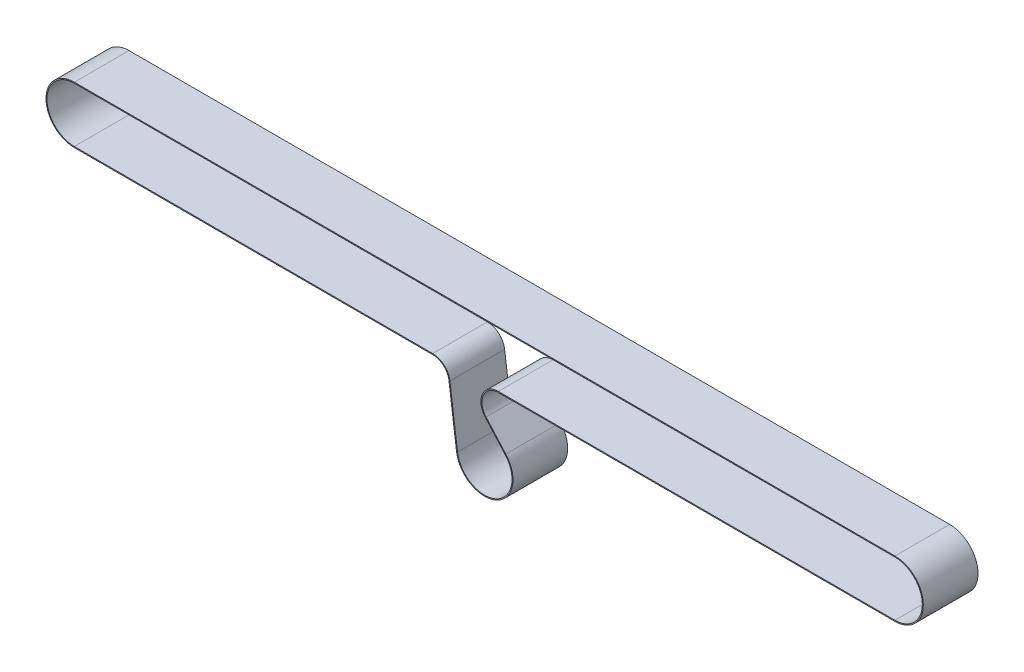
ISO-10303-21;
HEADER;
FILE_DESCRIPTION(('STEP AP214'),'2;1');
FILE_NAME('part.step','',(''),(''),'','','');
FILE_SCHEMA(('AUTOMOTIVE_DESIGN { 1 0 10303 214 1 1 1 1 }'));
ENDSEC;
DATA;
#1=APPLICATION_CONTEXT('core data for automotive mechanical design processes');
#2=APPLICATION_PROTOCOL_DEFINITION('international standard','automotive_design',2000,#1);
#3=PRODUCT_CONTEXT('',#1,'mechanical');
#4=PRODUCT('Part','Part','',(#3));
#5=PRODUCT_RELATED_PRODUCT_CATEGORY('part','',(#4));
#6=PRODUCT_DEFINITION_FORMATION('','',#4);
#7=PRODUCT_DEFINITION_CONTEXT('part definition',#1,'design');
#8=PRODUCT_DEFINITION('design','',#6,#7);
#9=PRODUCT_DEFINITION_SHAPE('','',#8);
#10=(LENGTH_UNIT() NAMED_UNIT(*) SI_UNIT(.MILLI.,.METRE.));
#11=(NAMED_UNIT(*) PLANE_ANGLE_UNIT() SI_UNIT($,.RADIAN.));
#12=(NAMED_UNIT(*) SI_UNIT($,.STERADIAN.) SOLID_ANGLE_UNIT());
#13=UNCERTAINTY_MEASURE_WITH_UNIT(LENGTH_MEASURE(1.E-05),#10,'distance_accuracy_value','');
#14=(GEOMETRIC_REPRESENTATION_CONTEXT(3) GLOBAL_UNCERTAINTY_ASSIGNED_CONTEXT((#13)) GLOBAL_UNIT_ASSIGNED_CONTEXT((#10,
#11,#12)) REPRESENTATION_CONTEXT('',''));
#15=CARTESIAN_POINT('',(0.,0.,0.));
#16=DIRECTION('',(0.,0.,1.));
#17=DIRECTION('',(1.,0.,0.));
#18=AXIS2_PLACEMENT_3D('',#15,#16,#17);
#19=CARTESIAN_POINT('',(0.,0.,25.));
#20=DIRECTION('',(0.,0.,1.));
#21=DIRECTION('',(1.,0.,0.));
#22=AXIS2_PLACEMENT_3D('',#19,#20,#21);
#23=PLANE('',#22);
#24=CARTESIAN_POINT('',(0.,0.,25.));
#25=DIRECTION('',(0.,0.,1.));
#26=DIRECTION('',(1.,0.,0.));
#27=AXIS2_PLACEMENT_3D('',#24,#25,#26);
#28=CIRCLE('',#27,25.9);
#29=CARTESIAN_POINT('',(0.,25.9,25.));
#30=VERTEX_POINT('',#29);
#31=CARTESIAN_POINT('',(-0.00790824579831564,-25.8999987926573,25.));
#32=VERTEX_POINT('',#31);
#33=EDGE_CURVE('E164',#30,#32,#28,.T.);
#34=ORIENTED_EDGE('',*,*,#33,.T.);
#35=DIRECTION('',(0.999999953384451,-0.000305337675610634,0.));
#36=VECTOR('',#35,1.);
#37=CARTESIAN_POINT('',(-0.00790824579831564,-25.8999987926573,25.));
#38=LINE('',#37,#36);
#39=CARTESIAN_POINT('',(327.504580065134,-26.0000006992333,25.));
#40=VERTEX_POINT('',#39);
#41=EDGE_CURVE('E267',#32,#40,#38,.T.);
#42=ORIENTED_EDGE('',*,*,#41,.T.);
#43=CARTESIAN_POINT('',(327.5,-41.,25.));
#44=DIRECTION('',(0.,0.,-1.));
#45=DIRECTION('',(-1.,0.,0.));
#46=AXIS2_PLACEMENT_3D('',#43,#44,#45);
#47=CIRCLE('',#46,15.);
#48=CARTESIAN_POINT('',(342.371906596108,-39.0438828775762,25.));
#49=VERTEX_POINT('',#48);
#50=EDGE_CURVE('E269',#40,#49,#47,.T.);
#51=ORIENTED_EDGE('',*,*,#50,.T.);
#52=DIRECTION('',(0.130407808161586,-0.991460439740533,0.));
#53=VECTOR('',#52,1.);
#54=CARTESIAN_POINT('',(342.371906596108,-39.0438828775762,25.));
#55=LINE('',#54,#53);
#56=CARTESIAN_POINT('',(349.321174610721,-91.8775622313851,25.));
#57=VERTEX_POINT('',#56);
#58=EDGE_CURVE('E271',#49,#57,#55,.T.);
#59=ORIENTED_EDGE('',*,*,#58,.T.);
#60=CARTESIAN_POINT('',(375.,-88.5,25.));
#61=DIRECTION('',(0.,0.,1.));
#62=DIRECTION('',(1.,0.,0.));
#63=AXIS2_PLACEMENT_3D('',#60,#61,#62);
#64=CIRCLE('',#63,25.9);
#65=CARTESIAN_POINT('',(394.357837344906,-71.2929045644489,25.));
#66=VERTEX_POINT('',#65);
#67=EDGE_CURVE('E273',#57,#66,#64,.T.);
#68=ORIENTED_EDGE('',*,*,#67,.T.);
#69=DIRECTION('',(-0.664366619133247,0.747406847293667,0.));
#70=VECTOR('',#69,1.);
#71=CARTESIAN_POINT('',(394.357837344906,-71.2929045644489,25.));
#72=LINE('',#71,#70);
#73=CARTESIAN_POINT('',(376.288897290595,-50.9654992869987,25.));
#74=VERTEX_POINT('',#73);
#75=EDGE_CURVE('E275',#66,#74,#72,.T.);
#76=ORIENTED_EDGE('',*,*,#75,.T.);
#77=CARTESIAN_POINT('',(387.5,-41.,25.));
#78=DIRECTION('',(0.,0.,-1.));
#79=DIRECTION('',(-1.,0.,0.));
#80=AXIS2_PLACEMENT_3D('',#77,#78,#79);
#81=CIRCLE('',#80,15.);
#82=CARTESIAN_POINT('',(387.495862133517,-26.0000005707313,25.));
#83=VERTEX_POINT('',#82);
#84=EDGE_CURVE('E277',#74,#83,#81,.T.);
#85=ORIENTED_EDGE('',*,*,#84,.T.);
#86=DIRECTION('',(0.999999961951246,0.000275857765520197,0.));
#87=VECTOR('',#86,1.);
#88=CARTESIAN_POINT('',(387.495862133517,-26.0000005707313,25.));
#89=LINE('',#88,#87);
#90=CARTESIAN_POINT('',(750.007144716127,-25.8999990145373,25.));
#91=VERTEX_POINT('',#90);
#92=EDGE_CURVE('E279',#83,#91,#89,.T.);
#93=ORIENTED_EDGE('',*,*,#92,.T.);
#94=CARTESIAN_POINT('',(750.003448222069,4.75609473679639E-07,25.));
#95=DIRECTION('',(0.,0.,1.));
#96=DIRECTION('',(1.,0.,0.));
#97=AXIS2_PLACEMENT_3D('',#94,#95,#96);
#98=CIRCLE('',#97,25.8999997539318);
#99=CARTESIAN_POINT('',(750.003448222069,25.9000002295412,25.));
#100=VERTEX_POINT('',#99);
#101=EDGE_CURVE('E281',#91,#100,#98,.T.);
#102=ORIENTED_EDGE('',*,*,#101,.T.);
#103=DIRECTION('',(-1.,-3.06053621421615E-10,0.));
#104=VECTOR('',#103,1.);
#105=CARTESIAN_POINT('',(750.003448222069,25.9000002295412,25.));
#106=LINE('',#105,#104);
#107=EDGE_CURVE('E39',#100,#30,#106,.T.);
#108=ORIENTED_EDGE('',*,*,#107,.T.);
#109=EDGE_LOOP('',(#34,#42,#51,#59,#68,#76,#85,#93,#102,#108));
#110=FACE_BOUND('',#109,.T.);
#111=DIRECTION('',(0.999999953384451,-0.000305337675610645,0.));
#112=VECTOR('',#111,1.);
#113=CARTESIAN_POINT('',(-0.00763344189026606,-24.9999988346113,25.));
#114=LINE('',#113,#112);
#115=CARTESIAN_POINT('',(-0.00763344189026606,-24.9999988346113,25.));
#116=VERTEX_POINT('',#115);
#117=CARTESIAN_POINT('',(327.504854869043,-25.1000007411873,25.));
#118=VERTEX_POINT('',#117);
#119=EDGE_CURVE('E232',#116,#118,#114,.T.);
#120=ORIENTED_EDGE('',*,*,#119,.F.);
#121=CARTESIAN_POINT('',(0.,0.,25.));
#122=DIRECTION('',(0.,0.,1.));
#123=DIRECTION('',(1.,0.,0.));
#124=AXIS2_PLACEMENT_3D('',#121,#122,#123);
#125=CIRCLE('',#124,25.);
#126=CARTESIAN_POINT('',(0.,25.,25.));
#127=VERTEX_POINT('',#126);
#128=EDGE_CURVE('E161',#127,#116,#125,.T.);
#129=ORIENTED_EDGE('',*,*,#128,.F.);
#130=DIRECTION('',(-1.,0.,0.));
#131=VECTOR('',#130,1.);
#132=CARTESIAN_POINT('',(750.,25.,25.));
#133=LINE('',#132,#131);
#134=CARTESIAN_POINT('',(750.,25.,25.));
#135=VERTEX_POINT('',#134);
#136=EDGE_CURVE('E248',#135,#127,#133,.T.);
#137=ORIENTED_EDGE('',*,*,#136,.F.);
#138=CARTESIAN_POINT('',(750.003448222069,4.75609473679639E-07,25.));
#139=DIRECTION('',(0.,0.,1.));
#140=DIRECTION('',(1.,0.,0.));
#141=AXIS2_PLACEMENT_3D('',#138,#139,#140);
#142=CIRCLE('',#141,24.9999997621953);
#143=CARTESIAN_POINT('',(750.006896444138,-24.9999990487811,25.));
#144=VERTEX_POINT('',#143);
#145=EDGE_CURVE('E246',#144,#135,#142,.T.);
#146=ORIENTED_EDGE('',*,*,#145,.F.);
#147=DIRECTION('',(0.999999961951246,0.000275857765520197,0.));
#148=VECTOR('',#147,1.);
#149=CARTESIAN_POINT('',(387.495613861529,-25.1000006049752,25.));
#150=LINE('',#149,#148);
#151=CARTESIAN_POINT('',(387.495613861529,-25.1000006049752,25.));
#152=VERTEX_POINT('',#151);
#153=EDGE_CURVE('E244',#152,#144,#150,.T.);
#154=ORIENTED_EDGE('',*,*,#153,.F.);
#155=CARTESIAN_POINT('',(387.5,-41.,25.));
#156=DIRECTION('',(0.,0.,-1.));
#157=DIRECTION('',(-1.,0.,0.));
#158=AXIS2_PLACEMENT_3D('',#155,#156,#157);
#159=CIRCLE('',#158,15.9);
#160=CARTESIAN_POINT('',(375.616231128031,-51.5634292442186,25.));
#161=VERTEX_POINT('',#160);
#162=EDGE_CURVE('E242',#161,#152,#159,.T.);
#163=ORIENTED_EDGE('',*,*,#162,.F.);
#164=DIRECTION('',(-0.664366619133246,0.747406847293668,0.));
#165=VECTOR('',#164,1.);
#166=CARTESIAN_POINT('',(393.685171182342,-71.8908345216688,25.));
#167=LINE('',#166,#165);
#168=CARTESIAN_POINT('',(393.685171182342,-71.8908345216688,25.));
#169=VERTEX_POINT('',#168);
#170=EDGE_CURVE('E240',#169,#161,#167,.T.);
#171=ORIENTED_EDGE('',*,*,#170,.F.);
#172=CARTESIAN_POINT('',(375.,-88.5,25.));
#173=DIRECTION('',(0.,0.,1.));
#174=DIRECTION('',(1.,0.,0.));
#175=AXIS2_PLACEMENT_3D('',#172,#173,#174);
#176=CIRCLE('',#175,25.);
#177=CARTESIAN_POINT('',(350.213489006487,-91.7601952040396,25.));
#178=VERTEX_POINT('',#177);
#179=EDGE_CURVE('E238',#178,#169,#176,.T.);
#180=ORIENTED_EDGE('',*,*,#179,.F.);
#181=DIRECTION('',(0.130407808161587,-0.991460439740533,0.));
#182=VECTOR('',#181,1.);
#183=CARTESIAN_POINT('',(343.264220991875,-38.9265158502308,25.));
#184=LINE('',#183,#182);
#185=CARTESIAN_POINT('',(343.264220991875,-38.9265158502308,25.));
#186=VERTEX_POINT('',#185);
#187=EDGE_CURVE('E236',#186,#178,#184,.T.);
#188=ORIENTED_EDGE('',*,*,#187,.F.);
#189=CARTESIAN_POINT('',(327.5,-41.,25.));
#190=DIRECTION('',(0.,0.,-1.));
#191=DIRECTION('',(-1.,0.,0.));
#192=AXIS2_PLACEMENT_3D('',#189,#190,#191);
#193=CIRCLE('',#192,15.9);
#194=EDGE_CURVE('E234',#118,#186,#193,.T.);
#195=ORIENTED_EDGE('',*,*,#194,.F.);
#196=EDGE_LOOP('',(#120,#129,#137,#146,#154,#163,#171,#180,#188,#195));
#197=FACE_BOUND('',#196,.T.);
#198=ADVANCED_FACE('F16',(#110,#197),#23,.T.);
#199=CARTESIAN_POINT('',(0.,0.,25.));
#200=DIRECTION('',(0.,0.,-1.));
#201=DIRECTION('',(-1.,0.,0.));
#202=AXIS2_PLACEMENT_3D('',#199,#200,#201);
#203=CYLINDRICAL_SURFACE('',#202,25.9);
#204=DIRECTION('',(0.,0.,-1.));
#205=VECTOR('',#204,1.);
#206=CARTESIAN_POINT('',(0.,25.9,25.));
#207=LINE('',#206,#205);
#208=CARTESIAN_POINT('',(0.,25.9,-25.));
#209=VERTEX_POINT('',#208);
#210=EDGE_CURVE('E284',#30,#209,#207,.T.);
#211=ORIENTED_EDGE('',*,*,#210,.T.);
#212=CARTESIAN_POINT('',(0.,0.,-25.));
#213=DIRECTION('',(0.,0.,1.));
#214=DIRECTION('',(1.,0.,0.));
#215=AXIS2_PLACEMENT_3D('',#212,#213,#214);
#216=CIRCLE('',#215,25.9);
#217=CARTESIAN_POINT('',(-0.00790824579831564,-25.8999987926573,-25.));
#218=VERTEX_POINT('',#217);
#219=EDGE_CURVE('E201',#209,#218,#216,.T.);
#220=ORIENTED_EDGE('',*,*,#219,.T.);
#221=DIRECTION('',(0.,0.,-1.));
#222=VECTOR('',#221,1.);
#223=CARTESIAN_POINT('',(-0.00790824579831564,-25.8999987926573,25.));
#224=LINE('',#223,#222);
#225=EDGE_CURVE('E11',#32,#218,#224,.T.);
#226=ORIENTED_EDGE('',*,*,#225,.F.);
#227=ORIENTED_EDGE('',*,*,#33,.F.);
#228=EDGE_LOOP('',(#211,#220,#226,#227));
#229=FACE_BOUND('',#228,.T.);
#230=ADVANCED_FACE('F18',(#229),#203,.T.);
#231=CARTESIAN_POINT('',(-0.00790824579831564,-25.8999987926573,25.));
#232=DIRECTION('',(0.000305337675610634,0.999999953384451,0.));
#233=DIRECTION('',(-0.999999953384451,0.000305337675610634,0.));
#234=AXIS2_PLACEMENT_3D('',#231,#232,#233);
#235=PLANE('',#234);
#236=ORIENTED_EDGE('',*,*,#225,.T.);
#237=DIRECTION('',(0.999999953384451,-0.000305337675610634,0.));
#238=VECTOR('',#237,1.);
#239=CARTESIAN_POINT('',(-0.00790824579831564,-25.8999987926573,-25.));
#240=LINE('',#239,#238);
#241=CARTESIAN_POINT('',(327.504580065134,-26.0000006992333,-25.));
#242=VERTEX_POINT('',#241);
#243=EDGE_CURVE('E204',#218,#242,#240,.T.);
#244=ORIENTED_EDGE('',*,*,#243,.T.);
#245=DIRECTION('',(0.,0.,-1.));
#246=VECTOR('',#245,1.);
#247=CARTESIAN_POINT('',(327.504580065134,-26.0000006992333,25.));
#248=LINE('',#247,#246);
#249=EDGE_CURVE('E24',#40,#242,#248,.T.);
#250=ORIENTED_EDGE('',*,*,#249,.F.);
#251=ORIENTED_EDGE('',*,*,#41,.F.);
#252=EDGE_LOOP('',(#236,#244,#250,#251));
#253=FACE_BOUND('',#252,.T.);
#254=ADVANCED_FACE('F310',(#253),#235,.F.);
#255=CARTESIAN_POINT('',(327.5,-41.,25.));
#256=DIRECTION('',(0.,0.,-1.));
#257=DIRECTION('',(-1.,0.,0.));
#258=AXIS2_PLACEMENT_3D('',#255,#256,#257);
#259=CYLINDRICAL_SURFACE('',#258,15.);
#260=ORIENTED_EDGE('',*,*,#249,.T.);
#261=CARTESIAN_POINT('',(327.5,-41.,-25.));
#262=DIRECTION('',(0.,0.,-1.));
#263=DIRECTION('',(-1.,0.,0.));
#264=AXIS2_PLACEMENT_3D('',#261,#262,#263);
#265=CIRCLE('',#264,15.);
#266=CARTESIAN_POINT('',(342.371906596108,-39.0438828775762,-25.));
#267=VERTEX_POINT('',#266);
#268=EDGE_CURVE('E207',#242,#267,#265,.T.);
#269=ORIENTED_EDGE('',*,*,#268,.T.);
#270=DIRECTION('',(0.,0.,-1.));
#271=VECTOR('',#270,1.);
#272=CARTESIAN_POINT('',(342.371906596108,-39.0438828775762,25.));
#273=LINE('',#272,#271);
#274=EDGE_CURVE('E298',#49,#267,#273,.T.);
#275=ORIENTED_EDGE('',*,*,#274,.F.);
#276=ORIENTED_EDGE('',*,*,#50,.F.);
#277=EDGE_LOOP('',(#260,#269,#275,#276));
#278=FACE_BOUND('',#277,.T.);
#279=ADVANCED_FACE('F303',(#278),#259,.F.);
#280=CARTESIAN_POINT('',(342.371906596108,-39.0438828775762,25.));
#281=DIRECTION('',(0.991460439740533,0.130407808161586,0.));
#282=DIRECTION('',(-0.130407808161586,0.991460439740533,0.));
#283=AXIS2_PLACEMENT_3D('',#280,#281,#282);
#284=PLANE('',#283);
#285=ORIENTED_EDGE('',*,*,#274,.T.);
#286=DIRECTION('',(0.130407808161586,-0.991460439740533,0.));
#287=VECTOR('',#286,1.);
#288=CARTESIAN_POINT('',(342.371906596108,-39.0438828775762,-25.));
#289=LINE('',#288,#287);
#290=CARTESIAN_POINT('',(349.321174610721,-91.8775622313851,-25.));
#291=VERTEX_POINT('',#290);
#292=EDGE_CURVE('E210',#267,#291,#289,.T.);
#293=ORIENTED_EDGE('',*,*,#292,.T.);
#294=DIRECTION('',(0.,0.,-1.));
#295=VECTOR('',#294,1.);
#296=CARTESIAN_POINT('',(349.321174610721,-91.8775622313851,25.));
#297=LINE('',#296,#295);
#298=EDGE_CURVE('E296',#57,#291,#297,.T.);
#299=ORIENTED_EDGE('',*,*,#298,.F.);
#300=ORIENTED_EDGE('',*,*,#58,.F.);
#301=EDGE_LOOP('',(#285,#293,#299,#300));
#302=FACE_BOUND('',#301,.T.);
#303=ADVANCED_FACE('F343',(#302),#284,.F.);
#304=CARTESIAN_POINT('',(375.,-88.5,25.));
#305=DIRECTION('',(0.,0.,-1.));
#306=DIRECTION('',(-1.,0.,0.));
#307=AXIS2_PLACEMENT_3D('',#304,#305,#306);
#308=CYLINDRICAL_SURFACE('',#307,25.9);
#309=ORIENTED_EDGE('',*,*,#298,.T.);
#310=CARTESIAN_POINT('',(375.,-88.5,-25.));
#311=DIRECTION('',(0.,0.,1.));
#312=DIRECTION('',(1.,0.,0.));
#313=AXIS2_PLACEMENT_3D('',#310,#311,#312);
#314=CIRCLE('',#313,25.9);
#315=CARTESIAN_POINT('',(394.357837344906,-71.2929045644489,-25.));
#316=VERTEX_POINT('',#315);
#317=EDGE_CURVE('E213',#291,#316,#314,.T.);
#318=ORIENTED_EDGE('',*,*,#317,.T.);
#319=DIRECTION('',(0.,0.,-1.));
#320=VECTOR('',#319,1.);
#321=CARTESIAN_POINT('',(394.357837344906,-71.2929045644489,25.));
#322=LINE('',#321,#320);
#323=EDGE_CURVE('E294',#66,#316,#322,.T.);
#324=ORIENTED_EDGE('',*,*,#323,.F.);
#325=ORIENTED_EDGE('',*,*,#67,.F.);
#326=EDGE_LOOP('',(#309,#318,#324,#325));
#327=FACE_BOUND('',#326,.T.);
#328=ADVANCED_FACE('F340',(#327),#308,.T.);
#329=CARTESIAN_POINT('',(394.357837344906,-71.2929045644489,25.));
#330=DIRECTION('',(-0.747406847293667,-0.664366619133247,0.));
#331=DIRECTION('',(0.664366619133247,-0.747406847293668,0.));
#332=AXIS2_PLACEMENT_3D('',#329,#330,#331);
#333=PLANE('',#332);
#334=ORIENTED_EDGE('',*,*,#323,.T.);
#335=DIRECTION('',(-0.664366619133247,0.747406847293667,0.));
#336=VECTOR('',#335,1.);
#337=CARTESIAN_POINT('',(394.357837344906,-71.2929045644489,-25.));
#338=LINE('',#337,#336);
#339=CARTESIAN_POINT('',(376.288897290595,-50.9654992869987,-25.));
#340=VERTEX_POINT('',#339);
#341=EDGE_CURVE('E216',#316,#340,#338,.T.);
#342=ORIENTED_EDGE('',*,*,#341,.T.);
#343=DIRECTION('',(0.,0.,-1.));
#344=VECTOR('',#343,1.);
#345=CARTESIAN_POINT('',(376.288897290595,-50.9654992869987,25.));
#346=LINE('',#345,#344);
#347=EDGE_CURVE('E292',#74,#340,#346,.T.);
#348=ORIENTED_EDGE('',*,*,#347,.F.);
#349=ORIENTED_EDGE('',*,*,#75,.F.);
#350=EDGE_LOOP('',(#334,#342,#348,#349));
#351=FACE_BOUND('',#350,.T.);
#352=ADVANCED_FACE('F335',(#351),#333,.F.);
#353=CARTESIAN_POINT('',(387.5,-41.,25.));
#354=DIRECTION('',(0.,0.,-1.));
#355=DIRECTION('',(-1.,0.,0.));
#356=AXIS2_PLACEMENT_3D('',#353,#354,#355);
#357=CYLINDRICAL_SURFACE('',#356,15.);
#358=ORIENTED_EDGE('',*,*,#347,.T.);
#359=CARTESIAN_POINT('',(387.5,-41.,-25.));
#360=DIRECTION('',(0.,0.,-1.));
#361=DIRECTION('',(-1.,0.,0.));
#362=AXIS2_PLACEMENT_3D('',#359,#360,#361);
#363=CIRCLE('',#362,15.);
#364=CARTESIAN_POINT('',(387.495862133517,-26.0000005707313,-25.));
#365=VERTEX_POINT('',#364);
#366=EDGE_CURVE('E219',#340,#365,#363,.T.);
#367=ORIENTED_EDGE('',*,*,#366,.T.);
#368=DIRECTION('',(0.,0.,-1.));
#369=VECTOR('',#368,1.);
#370=CARTESIAN_POINT('',(387.495862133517,-26.0000005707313,25.));
#371=LINE('',#370,#369);
#372=EDGE_CURVE('E290',#83,#365,#371,.T.);
#373=ORIENTED_EDGE('',*,*,#372,.F.);
#374=ORIENTED_EDGE('',*,*,#84,.F.);
#375=EDGE_LOOP('',(#358,#367,#373,#374));
#376=FACE_BOUND('',#375,.T.);
#377=ADVANCED_FACE('F331',(#376),#357,.F.);
#378=CARTESIAN_POINT('',(387.495862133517,-26.0000005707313,25.));
#379=DIRECTION('',(-0.000275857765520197,0.999999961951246,0.));
#380=DIRECTION('',(-0.999999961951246,-0.000275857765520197,0.));
#381=AXIS2_PLACEMENT_3D('',#378,#379,#380);
#382=PLANE('',#381);
#383=ORIENTED_EDGE('',*,*,#372,.T.);
#384=DIRECTION('',(0.999999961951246,0.000275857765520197,0.));
#385=VECTOR('',#384,1.);
#386=CARTESIAN_POINT('',(387.495862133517,-26.0000005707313,-25.));
#387=LINE('',#386,#385);
#388=CARTESIAN_POINT('',(750.007144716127,-25.8999990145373,-25.));
#389=VERTEX_POINT('',#388);
#390=EDGE_CURVE('E222',#365,#389,#387,.T.);
#391=ORIENTED_EDGE('',*,*,#390,.T.);
#392=DIRECTION('',(0.,0.,-1.));
#393=VECTOR('',#392,1.);
#394=CARTESIAN_POINT('',(750.007144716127,-25.8999990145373,25.));
#395=LINE('',#394,#393);
#396=EDGE_CURVE('E288',#91,#389,#395,.T.);
#397=ORIENTED_EDGE('',*,*,#396,.F.);
#398=ORIENTED_EDGE('',*,*,#92,.F.);
#399=EDGE_LOOP('',(#383,#391,#397,#398));
#400=FACE_BOUND('',#399,.T.);
#401=ADVANCED_FACE('F326',(#400),#382,.F.);
#402=CARTESIAN_POINT('',(750.003448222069,4.75609473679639E-07,25.));
#403=DIRECTION('',(0.,0.,-1.));
#404=DIRECTION('',(-1.,0.,0.));
#405=AXIS2_PLACEMENT_3D('',#402,#403,#404);
#406=CYLINDRICAL_SURFACE('',#405,25.8999997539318);
#407=ORIENTED_EDGE('',*,*,#396,.T.);
#408=CARTESIAN_POINT('',(750.003448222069,4.75609473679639E-07,-25.));
#409=DIRECTION('',(0.,0.,1.));
#410=DIRECTION('',(1.,0.,0.));
#411=AXIS2_PLACEMENT_3D('',#408,#409,#410);
#412=CIRCLE('',#411,25.8999997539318);
#413=CARTESIAN_POINT('',(750.003448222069,25.9000002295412,-25.));
#414=VERTEX_POINT('',#413);
#415=EDGE_CURVE('E225',#389,#414,#412,.T.);
#416=ORIENTED_EDGE('',*,*,#415,.T.);
#417=DIRECTION('',(0.,0.,-1.));
#418=VECTOR('',#417,1.);
#419=CARTESIAN_POINT('',(750.003448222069,25.9000002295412,25.));
#420=LINE('',#419,#418);
#421=EDGE_CURVE('E286',#100,#414,#420,.T.);
#422=ORIENTED_EDGE('',*,*,#421,.F.);
#423=ORIENTED_EDGE('',*,*,#101,.F.);
#424=EDGE_LOOP('',(#407,#416,#422,#423));
#425=FACE_BOUND('',#424,.T.);
#426=ADVANCED_FACE('F321',(#425),#406,.T.);
#427=CARTESIAN_POINT('',(750.003448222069,25.9000002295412,25.));
#428=DIRECTION('',(3.06053621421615E-10,-1.,0.));
#429=DIRECTION('',(1.,3.06053621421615E-10,0.));
#430=AXIS2_PLACEMENT_3D('',#427,#428,#429);
#431=PLANE('',#430);
#432=ORIENTED_EDGE('',*,*,#421,.T.);
#433=DIRECTION('',(-1.,-3.06053621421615E-10,0.));
#434=VECTOR('',#433,1.);
#435=CARTESIAN_POINT('',(750.003448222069,25.9000002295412,-25.));
#436=LINE('',#435,#434);
#437=EDGE_CURVE('E228',#414,#209,#436,.T.);
#438=ORIENTED_EDGE('',*,*,#437,.T.);
#439=ORIENTED_EDGE('',*,*,#210,.F.);
#440=ORIENTED_EDGE('',*,*,#107,.F.);
#441=EDGE_LOOP('',(#432,#438,#439,#440));
#442=FACE_BOUND('',#441,.T.);
#443=ADVANCED_FACE('F317',(#442),#431,.F.);
#444=CARTESIAN_POINT('',(0.,0.,25.));
#445=DIRECTION('',(0.,0.,-1.));
#446=DIRECTION('',(-1.,0.,0.));
#447=AXIS2_PLACEMENT_3D('',#444,#445,#446);
#448=CYLINDRICAL_SURFACE('',#447,25.);
#449=DIRECTION('',(0.,0.,-1.));
#450=VECTOR('',#449,1.);
#451=CARTESIAN_POINT('',(-0.00763344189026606,-24.9999988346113,25.));
#452=LINE('',#451,#450);
#453=CARTESIAN_POINT('',(-0.00763344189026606,-24.9999988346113,-25.));
#454=VERTEX_POINT('',#453);
#455=EDGE_CURVE('E153',#116,#454,#452,.T.);
#456=ORIENTED_EDGE('',*,*,#455,.T.);
#457=CARTESIAN_POINT('',(0.,0.,-25.));
#458=DIRECTION('',(0.,0.,1.));
#459=DIRECTION('',(1.,0.,0.));
#460=AXIS2_PLACEMENT_3D('',#457,#458,#459);
#461=CIRCLE('',#460,25.);
#462=CARTESIAN_POINT('',(0.,25.,-25.));
#463=VERTEX_POINT('',#462);
#464=EDGE_CURVE('E158',#463,#454,#461,.T.);
#465=ORIENTED_EDGE('',*,*,#464,.F.);
#466=DIRECTION('',(0.,0.,-1.));
#467=VECTOR('',#466,1.);
#468=CARTESIAN_POINT('',(0.,25.,25.));
#469=LINE('',#468,#467);
#470=EDGE_CURVE('E250',#127,#463,#469,.T.);
#471=ORIENTED_EDGE('',*,*,#470,.F.);
#472=ORIENTED_EDGE('',*,*,#128,.T.);
#473=EDGE_LOOP('',(#456,#465,#471,#472));
#474=FACE_BOUND('',#473,.T.);
#475=ADVANCED_FACE('F155',(#474),#448,.F.);
#476=CARTESIAN_POINT('',(-0.00763344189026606,-24.9999988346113,25.));
#477=DIRECTION('',(0.000305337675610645,0.999999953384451,0.));
#478=DIRECTION('',(-0.999999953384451,0.000305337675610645,0.));
#479=AXIS2_PLACEMENT_3D('',#476,#477,#478);
#480=PLANE('',#479);
#481=DIRECTION('',(0.,0.,-1.));
#482=VECTOR('',#481,1.);
#483=CARTESIAN_POINT('',(327.504854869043,-25.1000007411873,25.));
#484=LINE('',#483,#482);
#485=CARTESIAN_POINT('',(327.504854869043,-25.1000007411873,-25.));
#486=VERTEX_POINT('',#485);
#487=EDGE_CURVE('E165',#118,#486,#484,.T.);
#488=ORIENTED_EDGE('',*,*,#487,.T.);
#489=DIRECTION('',(0.999999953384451,-0.000305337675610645,0.));
#490=VECTOR('',#489,1.);
#491=CARTESIAN_POINT('',(-0.00763344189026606,-24.9999988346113,-25.));
#492=LINE('',#491,#490);
#493=EDGE_CURVE('E168',#454,#486,#492,.T.);
#494=ORIENTED_EDGE('',*,*,#493,.F.);
#495=ORIENTED_EDGE('',*,*,#455,.F.);
#496=ORIENTED_EDGE('',*,*,#119,.T.);
#497=EDGE_LOOP('',(#488,#494,#495,#496));
#498=FACE_BOUND('',#497,.T.);
#499=ADVANCED_FACE('F169',(#498),#480,.T.);
#500=CARTESIAN_POINT('',(327.5,-41.,25.));
#501=DIRECTION('',(0.,0.,-1.));
#502=DIRECTION('',(-1.,0.,0.));
#503=AXIS2_PLACEMENT_3D('',#500,#501,#502);
#504=CYLINDRICAL_SURFACE('',#503,15.9);
#505=DIRECTION('',(0.,0.,-1.));
#506=VECTOR('',#505,1.);
#507=CARTESIAN_POINT('',(343.264220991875,-38.9265158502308,25.));
#508=LINE('',#507,#506);
#509=CARTESIAN_POINT('',(343.264220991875,-38.9265158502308,-25.));
#510=VERTEX_POINT('',#509);
#511=EDGE_CURVE('E263',#186,#510,#508,.T.);
#512=ORIENTED_EDGE('',*,*,#511,.T.);
#513=CARTESIAN_POINT('',(327.5,-41.,-25.));
#514=DIRECTION('',(0.,0.,-1.));
#515=DIRECTION('',(-1.,0.,0.));
#516=AXIS2_PLACEMENT_3D('',#513,#514,#515);
#517=CIRCLE('',#516,15.9);
#518=EDGE_CURVE('E174',#486,#510,#517,.T.);
#519=ORIENTED_EDGE('',*,*,#518,.F.);
#520=ORIENTED_EDGE('',*,*,#487,.F.);
#521=ORIENTED_EDGE('',*,*,#194,.T.);
#522=EDGE_LOOP('',(#512,#519,#520,#521));
#523=FACE_BOUND('',#522,.T.);
#524=ADVANCED_FACE('F352',(#523),#504,.T.);
#525=CARTESIAN_POINT('',(343.264220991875,-38.9265158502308,25.));
#526=DIRECTION('',(0.991460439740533,0.130407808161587,0.));
#527=DIRECTION('',(-0.130407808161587,0.991460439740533,0.));
#528=AXIS2_PLACEMENT_3D('',#525,#526,#527);
#529=PLANE('',#528);
#530=DIRECTION('',(0.,0.,-1.));
#531=VECTOR('',#530,1.);
#532=CARTESIAN_POINT('',(350.213489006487,-91.7601952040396,25.));
#533=LINE('',#532,#531);
#534=CARTESIAN_POINT('',(350.213489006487,-91.7601952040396,-25.));
#535=VERTEX_POINT('',#534);
#536=EDGE_CURVE('E261',#178,#535,#533,.T.);
#537=ORIENTED_EDGE('',*,*,#536,.T.);
#538=DIRECTION('',(0.130407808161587,-0.991460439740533,0.));
#539=VECTOR('',#538,1.);
#540=CARTESIAN_POINT('',(343.264220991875,-38.9265158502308,-25.));
#541=LINE('',#540,#539);
#542=EDGE_CURVE('E183',#510,#535,#541,.T.);
#543=ORIENTED_EDGE('',*,*,#542,.F.);
#544=ORIENTED_EDGE('',*,*,#511,.F.);
#545=ORIENTED_EDGE('',*,*,#187,.T.);
#546=EDGE_LOOP('',(#537,#543,#544,#545));
#547=FACE_BOUND('',#546,.T.);
#548=ADVANCED_FACE('F357',(#547),#529,.T.);
#549=CARTESIAN_POINT('',(375.,-88.5,25.));
#550=DIRECTION('',(0.,0.,-1.));
#551=DIRECTION('',(-1.,0.,0.));
#552=AXIS2_PLACEMENT_3D('',#549,#550,#551);
#553=CYLINDRICAL_SURFACE('',#552,25.);
#554=DIRECTION('',(0.,0.,-1.));
#555=VECTOR('',#554,1.);
#556=CARTESIAN_POINT('',(393.685171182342,-71.8908345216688,25.));
#557=LINE('',#556,#555);
#558=CARTESIAN_POINT('',(393.685171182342,-71.8908345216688,-25.));
#559=VERTEX_POINT('',#558);
#560=EDGE_CURVE('E259',#169,#559,#557,.T.);
#561=ORIENTED_EDGE('',*,*,#560,.T.);
#562=CARTESIAN_POINT('',(375.,-88.5,-25.));
#563=DIRECTION('',(0.,0.,1.));
#564=DIRECTION('',(1.,0.,0.));
#565=AXIS2_PLACEMENT_3D('',#562,#563,#564);
#566=CIRCLE('',#565,25.);
#567=EDGE_CURVE('E186',#535,#559,#566,.T.);
#568=ORIENTED_EDGE('',*,*,#567,.F.);
#569=ORIENTED_EDGE('',*,*,#536,.F.);
#570=ORIENTED_EDGE('',*,*,#179,.T.);
#571=EDGE_LOOP('',(#561,#568,#569,#570));
#572=FACE_BOUND('',#571,.T.);
#573=ADVANCED_FACE('F361',(#572),#553,.F.);
#574=CARTESIAN_POINT('',(393.685171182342,-71.8908345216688,25.));
#575=DIRECTION('',(-0.747406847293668,-0.664366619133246,0.));
#576=DIRECTION('',(0.664366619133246,-0.747406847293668,0.));
#577=AXIS2_PLACEMENT_3D('',#574,#575,#576);
#578=PLANE('',#577);
#579=DIRECTION('',(0.,0.,-1.));
#580=VECTOR('',#579,1.);
#581=CARTESIAN_POINT('',(375.616231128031,-51.5634292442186,25.));
#582=LINE('',#581,#580);
#583=CARTESIAN_POINT('',(375.616231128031,-51.5634292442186,-25.));
#584=VERTEX_POINT('',#583);
#585=EDGE_CURVE('E257',#161,#584,#582,.T.);
#586=ORIENTED_EDGE('',*,*,#585,.T.);
#587=DIRECTION('',(-0.664366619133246,0.747406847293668,0.));
#588=VECTOR('',#587,1.);
#589=CARTESIAN_POINT('',(393.685171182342,-71.8908345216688,-25.));
#590=LINE('',#589,#588);
#591=EDGE_CURVE('E189',#559,#584,#590,.T.);
#592=ORIENTED_EDGE('',*,*,#591,.F.);
#593=ORIENTED_EDGE('',*,*,#560,.F.);
#594=ORIENTED_EDGE('',*,*,#170,.T.);
#595=EDGE_LOOP('',(#586,#592,#593,#594));
#596=FACE_BOUND('',#595,.T.);
#597=ADVANCED_FACE('F366',(#596),#578,.T.);
#598=CARTESIAN_POINT('',(387.5,-41.,25.));
#599=DIRECTION('',(0.,0.,-1.));
#600=DIRECTION('',(-1.,0.,0.));
#601=AXIS2_PLACEMENT_3D('',#598,#599,#600);
#602=CYLINDRICAL_SURFACE('',#601,15.9);
#603=DIRECTION('',(0.,0.,-1.));
#604=VECTOR('',#603,1.);
#605=CARTESIAN_POINT('',(387.495613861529,-25.1000006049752,25.));
#606=LINE('',#605,#604);
#607=CARTESIAN_POINT('',(387.495613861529,-25.1000006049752,-25.));
#608=VERTEX_POINT('',#607);
#609=EDGE_CURVE('E255',#152,#608,#606,.T.);
#610=ORIENTED_EDGE('',*,*,#609,.T.);
#611=CARTESIAN_POINT('',(387.5,-41.,-25.));
#612=DIRECTION('',(0.,0.,-1.));
#613=DIRECTION('',(-1.,0.,0.));
#614=AXIS2_PLACEMENT_3D('',#611,#612,#613);
#615=CIRCLE('',#614,15.9);
#616=EDGE_CURVE('E192',#584,#608,#615,.T.);
#617=ORIENTED_EDGE('',*,*,#616,.F.);
#618=ORIENTED_EDGE('',*,*,#585,.F.);
#619=ORIENTED_EDGE('',*,*,#162,.T.);
#620=EDGE_LOOP('',(#610,#617,#618,#619));
#621=FACE_BOUND('',#620,.T.);
#622=ADVANCED_FACE('F371',(#621),#602,.T.);
#623=CARTESIAN_POINT('',(387.495613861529,-25.1000006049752,25.));
#624=DIRECTION('',(-0.000275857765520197,0.999999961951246,0.));
#625=DIRECTION('',(-0.999999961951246,-0.000275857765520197,0.));
#626=AXIS2_PLACEMENT_3D('',#623,#624,#625);
#627=PLANE('',#626);
#628=DIRECTION('',(0.,0.,-1.));
#629=VECTOR('',#628,1.);
#630=CARTESIAN_POINT('',(750.006896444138,-24.9999990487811,25.));
#631=LINE('',#630,#629);
#632=CARTESIAN_POINT('',(750.006896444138,-24.9999990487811,-25.));
#633=VERTEX_POINT('',#632);
#634=EDGE_CURVE('E253',#144,#633,#631,.T.);
#635=ORIENTED_EDGE('',*,*,#634,.T.);
#636=DIRECTION('',(0.999999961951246,0.000275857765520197,0.));
#637=VECTOR('',#636,1.);
#638=CARTESIAN_POINT('',(387.495613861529,-25.1000006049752,-25.));
#639=LINE('',#638,#637);
#640=EDGE_CURVE('E195',#608,#633,#639,.T.);
#641=ORIENTED_EDGE('',*,*,#640,.F.);
#642=ORIENTED_EDGE('',*,*,#609,.F.);
#643=ORIENTED_EDGE('',*,*,#153,.T.);
#644=EDGE_LOOP('',(#635,#641,#642,#643));
#645=FACE_BOUND('',#644,.T.);
#646=ADVANCED_FACE('F376',(#645),#627,.T.);
#647=CARTESIAN_POINT('',(750.003448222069,4.75609473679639E-07,25.));
#648=DIRECTION('',(0.,0.,-1.));
#649=DIRECTION('',(-1.,0.,0.));
#650=AXIS2_PLACEMENT_3D('',#647,#648,#649);
#651=CYLINDRICAL_SURFACE('',#650,24.9999997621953);
#652=DIRECTION('',(0.,0.,-1.));
#653=VECTOR('',#652,1.);
#654=CARTESIAN_POINT('',(750.,25.,25.));
#655=LINE('',#654,#653);
#656=CARTESIAN_POINT('',(750.,25.,-25.));
#657=VERTEX_POINT('',#656);
#658=EDGE_CURVE('E31',#135,#657,#655,.T.);
#659=ORIENTED_EDGE('',*,*,#658,.T.);
#660=CARTESIAN_POINT('',(750.003448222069,4.75609473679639E-07,-25.));
#661=DIRECTION('',(0.,0.,1.));
#662=DIRECTION('',(1.,0.,0.));
#663=AXIS2_PLACEMENT_3D('',#660,#661,#662);
#664=CIRCLE('',#663,24.9999997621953);
#665=EDGE_CURVE('E198',#633,#657,#664,.T.);
#666=ORIENTED_EDGE('',*,*,#665,.F.);
#667=ORIENTED_EDGE('',*,*,#634,.F.);
#668=ORIENTED_EDGE('',*,*,#145,.T.);
#669=EDGE_LOOP('',(#659,#666,#667,#668));
#670=FACE_BOUND('',#669,.T.);
#671=ADVANCED_FACE('F381',(#670),#651,.F.);
#672=CARTESIAN_POINT('',(750.,25.,25.));
#673=DIRECTION('',(0.,-1.,0.));
#674=DIRECTION('',(0.,0.,-1.));
#675=AXIS2_PLACEMENT_3D('',#672,#673,#674);
#676=PLANE('',#675);
#677=ORIENTED_EDGE('',*,*,#470,.T.);
#678=DIRECTION('',(-1.,0.,0.));
#679=VECTOR('',#678,1.);
#680=CARTESIAN_POINT('',(750.,25.,-25.));
#681=LINE('',#680,#679);
#682=EDGE_CURVE('E179',#657,#463,#681,.T.);
#683=ORIENTED_EDGE('',*,*,#682,.F.);
#684=ORIENTED_EDGE('',*,*,#658,.F.);
#685=ORIENTED_EDGE('',*,*,#136,.T.);
#686=EDGE_LOOP('',(#677,#683,#684,#685));
#687=FACE_BOUND('',#686,.T.);
#688=ADVANCED_FACE('F382',(#687),#676,.T.);
#689=CARTESIAN_POINT('',(0.,0.,-25.));
#690=DIRECTION('',(0.,0.,1.));
#691=DIRECTION('',(1.,0.,0.));
#692=AXIS2_PLACEMENT_3D('',#689,#690,#691);
#693=PLANE('',#692);
#694=ORIENTED_EDGE('',*,*,#682,.T.);
#695=ORIENTED_EDGE('',*,*,#464,.T.);
#696=ORIENTED_EDGE('',*,*,#493,.T.);
#697=ORIENTED_EDGE('',*,*,#518,.T.);
#698=ORIENTED_EDGE('',*,*,#542,.T.);
#699=ORIENTED_EDGE('',*,*,#567,.T.);
#700=ORIENTED_EDGE('',*,*,#591,.T.);
#701=ORIENTED_EDGE('',*,*,#616,.T.);
#702=ORIENTED_EDGE('',*,*,#640,.T.);
#703=ORIENTED_EDGE('',*,*,#665,.T.);
#704=EDGE_LOOP('',(#694,#695,#696,#697,#698,#699,#700,#701,#702,#703));
#705=FACE_BOUND('',#704,.T.);
#706=ORIENTED_EDGE('',*,*,#219,.F.);
#707=ORIENTED_EDGE('',*,*,#437,.F.);
#708=ORIENTED_EDGE('',*,*,#415,.F.);
#709=ORIENTED_EDGE('',*,*,#390,.F.);
#710=ORIENTED_EDGE('',*,*,#366,.F.);
#711=ORIENTED_EDGE('',*,*,#341,.F.);
#712=ORIENTED_EDGE('',*,*,#317,.F.);
#713=ORIENTED_EDGE('',*,*,#292,.F.);
#714=ORIENTED_EDGE('',*,*,#268,.F.);
#715=ORIENTED_EDGE('',*,*,#243,.F.);
#716=EDGE_LOOP('',(#706,#707,#708,#709,#710,#711,#712,#713,#714,#715));
#717=FACE_BOUND('',#716,.T.);
#718=ADVANCED_FACE('F176',(#705,#717),#693,.F.);
#719=CLOSED_SHELL('',(#198,#230,#254,#279,#303,#328,#352,#377,#401,#426,#443,#475,#499,#524,
#548,#573,#597,#622,#646,#671,#688,#718));
#720=MANIFOLD_SOLID_BREP('B1',#719);
#721=ADVANCED_BREP_SHAPE_REPRESENTATION('',(#18,#720),#14);
#722=SHAPE_DEFINITION_REPRESENTATION(#9,#721);
ENDSEC;
END-ISO-10303-21;
